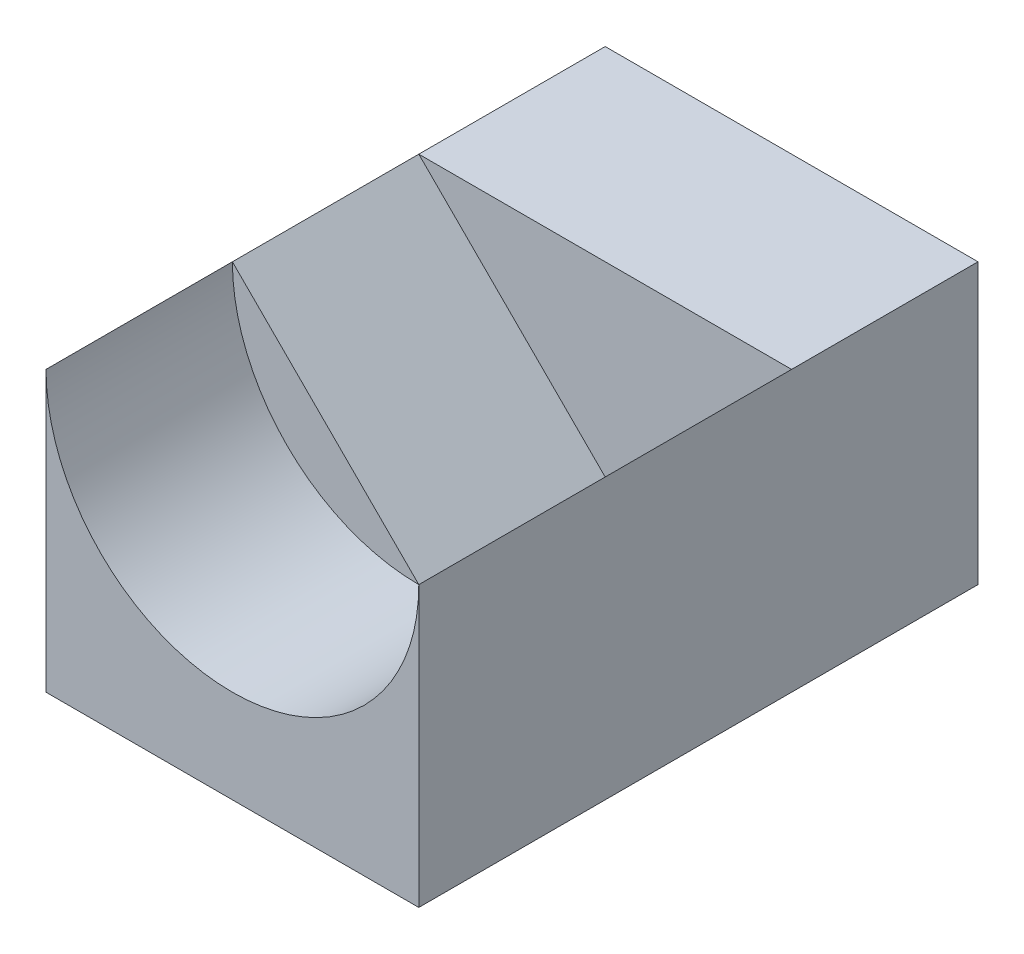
from build123d import *

# Parameters (mm, degrees)
SKETCH1_W      = 40
SKETCH1_H      = 30
EXTRUDE1_DEPTH = 60
SKETCH2_R      = 20
EXTRUDE2_DEPTH = 20
EXTRUDE4_DEPTH = 20


with BuildPart() as part:
    # Sketch1 → Extrude1 (new body)
    with BuildSketch(Plane.XY):
        with Locations((0, 15)):
            Rectangle(SKETCH1_W, SKETCH1_H)
    extrude(amount=EXTRUDE1_DEPTH)

    # Sketch2 → Extrude2 (cut)
    with BuildSketch(Plane.XY.offset(60)):
        with Locations((0, 30)):
            Circle(SKETCH2_R)
    extrude(amount=-EXTRUDE2_DEPTH, mode=Mode.SUBTRACT)

    # Sketch3 → Extrude4 (cut)
    with BuildSketch(Plane.XY.offset(40)):
        Polygon((-20, 30), (20, 30), (0, 10), align=None)
    extrude(amount=-EXTRUDE4_DEPTH, mode=Mode.SUBTRACT)


solid = part.part
